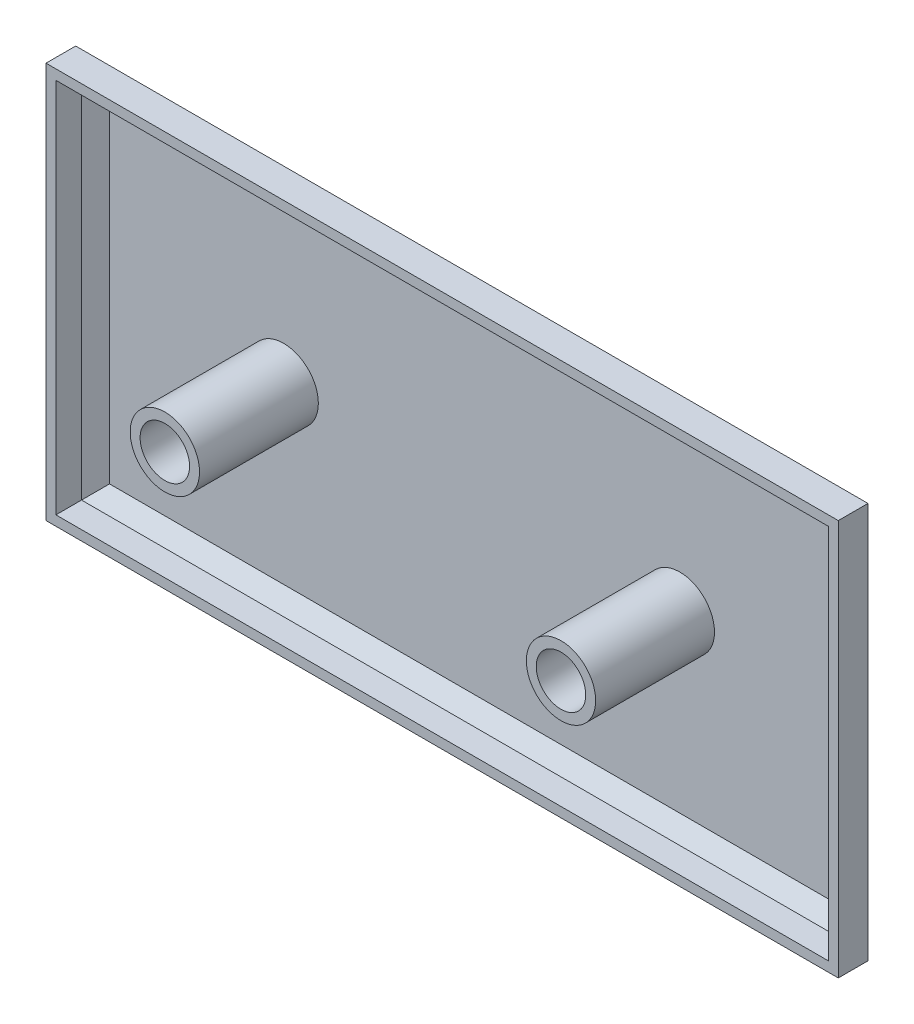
from build123d import *

# Parameters (mm, degrees)
SKETCH_1_W      = 80
SKETCH_1_H      = 40
EXTRUDE_1_DEPTH = 2.5
CHAMFER_1_SIZE  = 2
SHELL_1_T       = -1
SKETCH_2_R      = 3.5
SKETCH_2_R_2    = 2.5
EXTRUDE_2_DEPTH = 12


with BuildPart() as part:
    # Sketch 1 → Extrude 1 (new, symmetric)
    with BuildSketch(Plane.XY):
        Rectangle(SKETCH_1_W, SKETCH_1_H)
    extrude(amount=EXTRUDE_1_DEPTH, both=True)

    # Chamfer 1
    chamfer_1_edges = [part.edges().sort_by_distance(p)[0] for p in [
        (0, 20, -2.5),
        (40, 0, -2.5),
        (0, -20, -2.5),
        (-40, 0, -2.5),
    ]]
    chamfer(chamfer_1_edges, length=CHAMFER_1_SIZE)

    # Shell 1
    shell_1_openings = [part.faces().sort_by_distance(p)[0] for p in [
        (0, 0, 2.5),
    ]]
    offset(amount=SHELL_1_T, openings=shell_1_openings, kind=Kind.INTERSECTION)

    # Sketch 2 → Extrude 2 (add)
    # profile 1 of 2: a face of its own
    with BuildSketch(Plane.XY.offset(-1.5)):
        with Locations((-20, 0)):
            Circle(SKETCH_2_R)
        with Locations((-20, 0)):
            Circle(SKETCH_2_R_2, mode=Mode.SUBTRACT)
    # profile 2 of 2: a face of its own
    with BuildSketch(Plane.XY.offset(-1.5)):
        with Locations((20, 0)):
            Circle(SKETCH_2_R)
        with Locations((20, 0)):
            Circle(SKETCH_2_R_2, mode=Mode.SUBTRACT)
    extrude(amount=EXTRUDE_2_DEPTH)


solid = part.part
